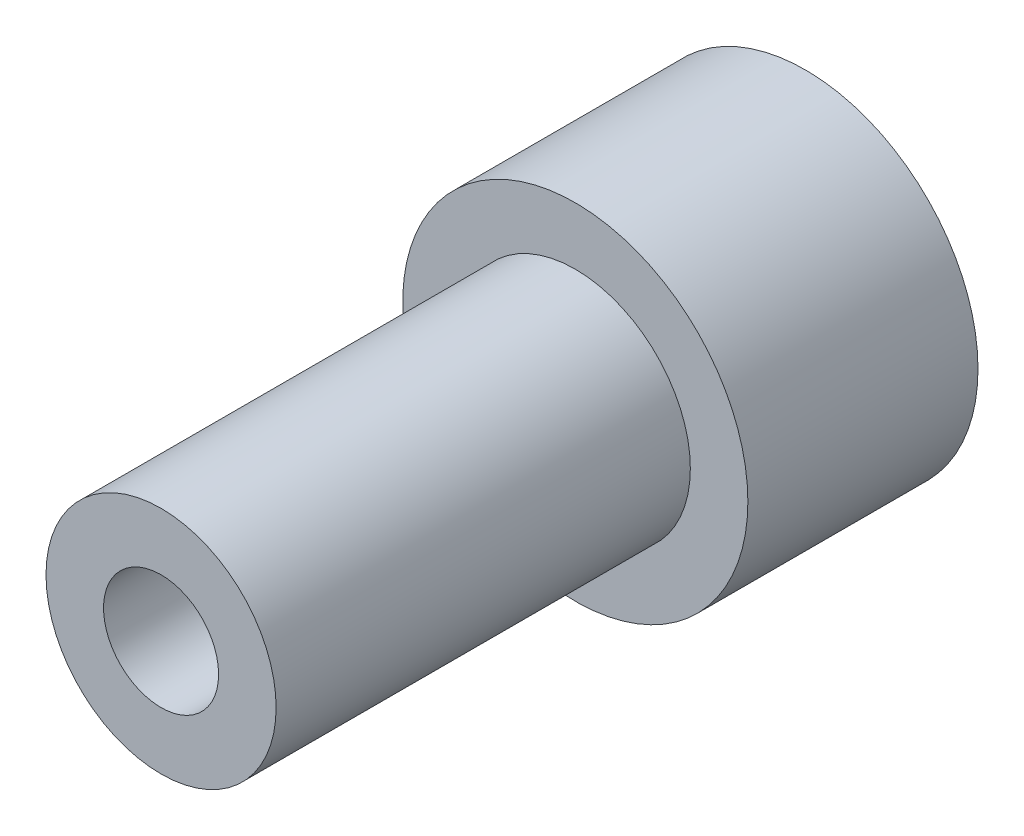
from build123d import *

# Parameters (mm, degrees)
SKETCH1_R           = 4.7625
BASE_EXTRUDE_DEPTH  = 6.35
SKETCH2_R           = 3.175
BOSS_EXTRUDE1_DEPTH = 11.43
SKETCH3_R           = 1.5875
CUT_EXTRUDE1_DEPTH  = 20.01292225
CUT_EXTRUDE2_DEPTH  = 3.683


with BuildPart() as part:
    # Sketch1 → Base-Extrude (new body)
    with BuildSketch(Plane.XY):
        Circle(SKETCH1_R)
    extrude(amount=BASE_EXTRUDE_DEPTH)

    # Sketch2 → Boss-Extrude1 (add)
    with BuildSketch(Plane.XY.offset(6.35)):
        Circle(SKETCH2_R)
    extrude(amount=BOSS_EXTRUDE1_DEPTH)

    # Sketch3 → Cut-Extrude1 (cut, through all)
    with BuildSketch(Plane.XY.offset(17.78)):
        Circle(SKETCH3_R)
    extrude(amount=-CUT_EXTRUDE1_DEPTH, mode=Mode.SUBTRACT)

    # Sketch4 → Cut-Extrude2 (cut)
    with BuildSketch(Plane(origin=(0, 0, 0), x_dir=(-1, 0, 0), z_dir=(0, 0, -1))):
        Polygon((2.38125, 1.374815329), (2.38125, -1.374815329), (0, -2.749630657), (-2.38125, -1.374815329), (-2.38125, 1.374815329), (0, 2.749630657), align=None)
    extrude(amount=-CUT_EXTRUDE2_DEPTH, mode=Mode.SUBTRACT)


solid = part.part
